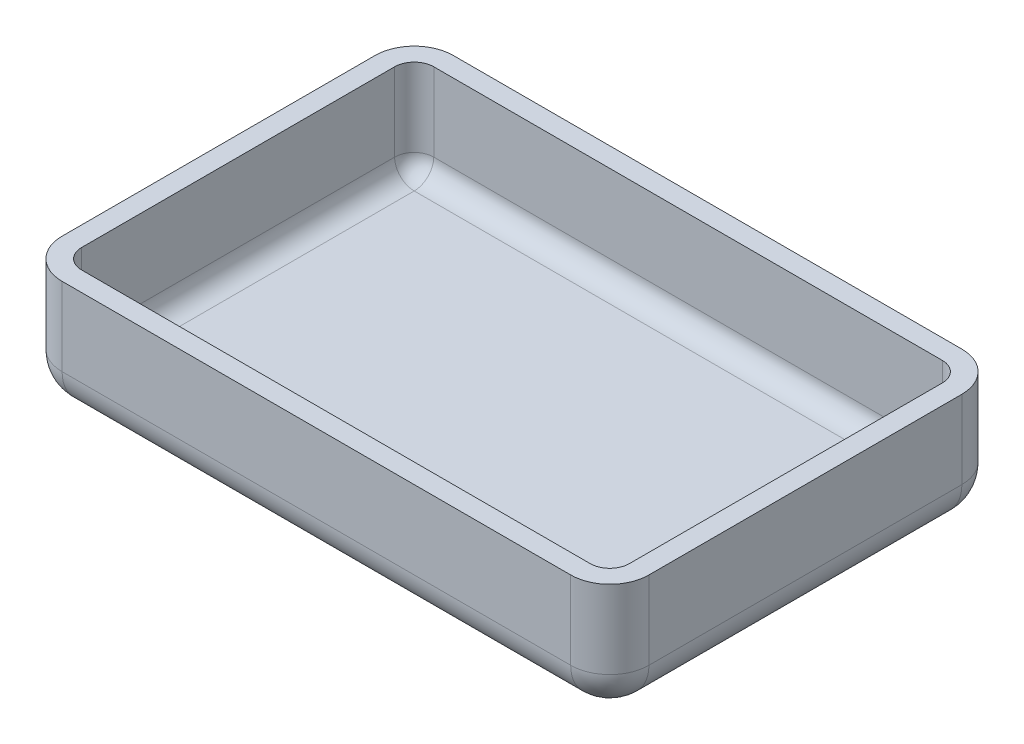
from build123d import *

# Parameters (mm, degrees)
SKETCH2_W      = 150
SKETCH2_H      = 100
EXTRUDE1_DEPTH = 30
FILLET1_R      = 10
SHELL1_T       = -5


with BuildPart() as part:
    # Sketch2 → Extrude1 (new body)
    with BuildSketch(Plane(origin=(0, 0, 0), x_dir=(1, 0, 0), z_dir=(0, 1, 0))):
        Rectangle(SKETCH2_W, SKETCH2_H)
    extrude(amount=EXTRUDE1_DEPTH)

    # Fillet1
    fillet1_edges = [part.edges().sort_by_distance(p)[0] for p in [
        (0, 0, -50),
        (75, 0, 0),
        (0, 0, 50),
        (-75, 0, 0),
        (-75, 15, -50),
        (75, 15, -50),
        (75, 15, 50),
        (-75, 15, 50),
    ]]
    fillet(fillet1_edges, radius=FILLET1_R)

    # Shell1
    shell1_openings = [part.faces().sort_by_distance(p)[0] for p in [
        (0, 30, 0),
    ]]
    offset(amount=SHELL1_T, openings=shell1_openings, kind=Kind.INTERSECTION)


solid = part.part
